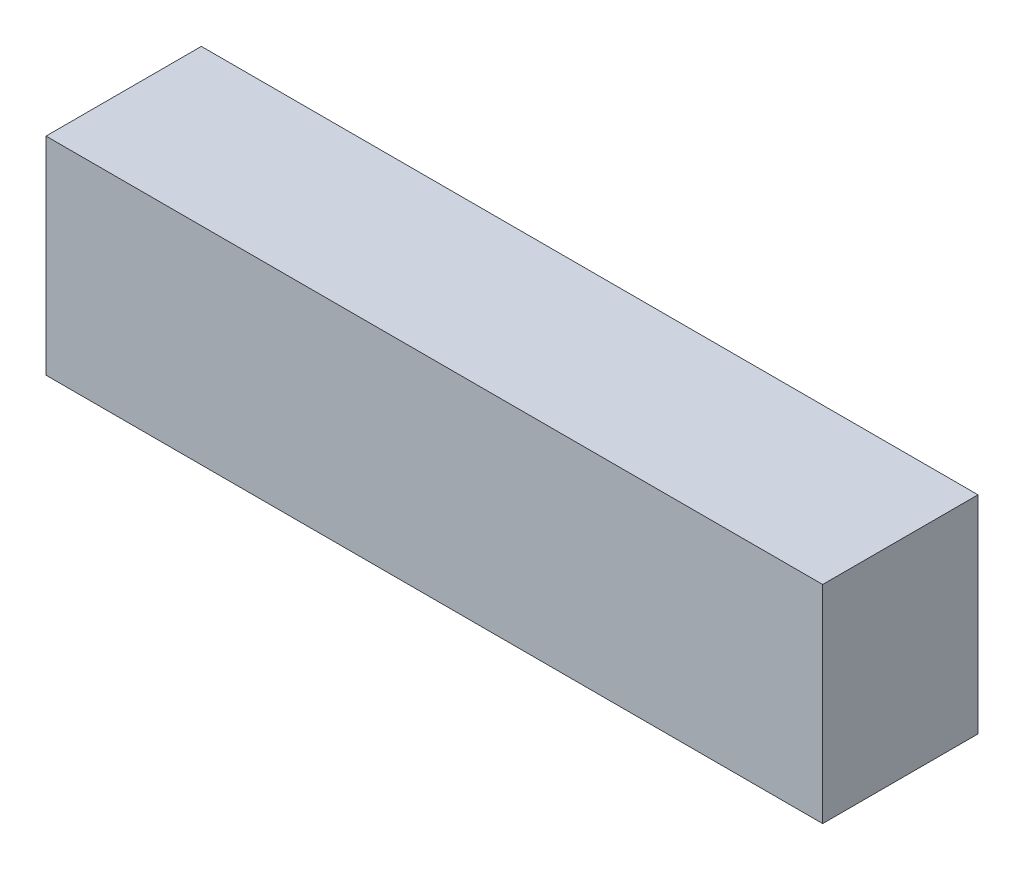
ISO-10303-21;
HEADER;
FILE_DESCRIPTION(('STEP AP214'),'2;1');
FILE_NAME('part.step','',(''),(''),'','','');
FILE_SCHEMA(('AUTOMOTIVE_DESIGN { 1 0 10303 214 1 1 1 1 }'));
ENDSEC;
DATA;
#1=APPLICATION_CONTEXT('core data for automotive mechanical design processes');
#2=APPLICATION_PROTOCOL_DEFINITION('international standard','automotive_design',2000,#1);
#3=PRODUCT_CONTEXT('',#1,'mechanical');
#4=PRODUCT('Part','Part','',(#3));
#5=PRODUCT_RELATED_PRODUCT_CATEGORY('part','',(#4));
#6=PRODUCT_DEFINITION_FORMATION('','',#4);
#7=PRODUCT_DEFINITION_CONTEXT('part definition',#1,'design');
#8=PRODUCT_DEFINITION('design','',#6,#7);
#9=PRODUCT_DEFINITION_SHAPE('','',#8);
#10=(LENGTH_UNIT() NAMED_UNIT(*) SI_UNIT(.MILLI.,.METRE.));
#11=(NAMED_UNIT(*) PLANE_ANGLE_UNIT() SI_UNIT($,.RADIAN.));
#12=(NAMED_UNIT(*) SI_UNIT($,.STERADIAN.) SOLID_ANGLE_UNIT());
#13=UNCERTAINTY_MEASURE_WITH_UNIT(LENGTH_MEASURE(1.E-05),#10,'distance_accuracy_value','');
#14=(GEOMETRIC_REPRESENTATION_CONTEXT(3) GLOBAL_UNCERTAINTY_ASSIGNED_CONTEXT((#13)) GLOBAL_UNIT_ASSIGNED_CONTEXT((#10,
#11,#12)) REPRESENTATION_CONTEXT('',''));
#15=CARTESIAN_POINT('',(0.,0.,0.));
#16=DIRECTION('',(0.,0.,1.));
#17=DIRECTION('',(1.,0.,0.));
#18=AXIS2_PLACEMENT_3D('',#15,#16,#17);
#19=CARTESIAN_POINT('',(95.25,25.4,38.1));
#20=DIRECTION('',(-1.,0.,0.));
#21=DIRECTION('',(0.,-1.,0.));
#22=AXIS2_PLACEMENT_3D('',#19,#20,#21);
#23=PLANE('',#22);
#24=DIRECTION('',(0.,1.,0.));
#25=VECTOR('',#24,1.);
#26=CARTESIAN_POINT('',(95.25,25.4,0.));
#27=LINE('',#26,#25);
#28=CARTESIAN_POINT('',(95.25,-25.4,0.));
#29=VERTEX_POINT('',#28);
#30=CARTESIAN_POINT('',(95.25,25.4,0.));
#31=VERTEX_POINT('',#30);
#32=EDGE_CURVE('E98',#29,#31,#27,.T.);
#33=ORIENTED_EDGE('',*,*,#32,.T.);
#34=DIRECTION('',(0.,0.,-1.));
#35=VECTOR('',#34,1.);
#36=CARTESIAN_POINT('',(95.25,25.4,38.1));
#37=LINE('',#36,#35);
#38=CARTESIAN_POINT('',(95.25,25.4,38.1));
#39=VERTEX_POINT('',#38);
#40=EDGE_CURVE('E11',#39,#31,#37,.T.);
#41=ORIENTED_EDGE('',*,*,#40,.F.);
#42=DIRECTION('',(0.,1.,0.));
#43=VECTOR('',#42,1.);
#44=CARTESIAN_POINT('',(95.25,25.4,38.1));
#45=LINE('',#44,#43);
#46=CARTESIAN_POINT('',(95.25,-25.4,38.1));
#47=VERTEX_POINT('',#46);
#48=EDGE_CURVE('E86',#47,#39,#45,.T.);
#49=ORIENTED_EDGE('',*,*,#48,.F.);
#50=DIRECTION('',(0.,0.,-1.));
#51=VECTOR('',#50,1.);
#52=CARTESIAN_POINT('',(95.25,-25.4,38.1));
#53=LINE('',#52,#51);
#54=EDGE_CURVE('E94',#47,#29,#53,.T.);
#55=ORIENTED_EDGE('',*,*,#54,.T.);
#56=EDGE_LOOP('',(#33,#41,#49,#55));
#57=FACE_BOUND('',#56,.T.);
#58=ADVANCED_FACE('F35',(#57),#23,.F.);
#59=CARTESIAN_POINT('',(-95.25,25.4,38.1));
#60=DIRECTION('',(0.,-1.,0.));
#61=DIRECTION('',(1.,0.,0.));
#62=AXIS2_PLACEMENT_3D('',#59,#60,#61);
#63=PLANE('',#62);
#64=DIRECTION('',(-1.,0.,0.));
#65=VECTOR('',#64,1.);
#66=CARTESIAN_POINT('',(-95.25,25.4,0.));
#67=LINE('',#66,#65);
#68=CARTESIAN_POINT('',(-95.25,25.4,0.));
#69=VERTEX_POINT('',#68);
#70=EDGE_CURVE('E90',#31,#69,#67,.T.);
#71=ORIENTED_EDGE('',*,*,#70,.T.);
#72=DIRECTION('',(0.,0.,-1.));
#73=VECTOR('',#72,1.);
#74=CARTESIAN_POINT('',(-95.25,25.4,38.1));
#75=LINE('',#74,#73);
#76=CARTESIAN_POINT('',(-95.25,25.4,38.1));
#77=VERTEX_POINT('',#76);
#78=EDGE_CURVE('E43',#77,#69,#75,.T.);
#79=ORIENTED_EDGE('',*,*,#78,.F.);
#80=DIRECTION('',(-1.,0.,0.));
#81=VECTOR('',#80,1.);
#82=CARTESIAN_POINT('',(-95.25,25.4,38.1));
#83=LINE('',#82,#81);
#84=EDGE_CURVE('E81',#39,#77,#83,.T.);
#85=ORIENTED_EDGE('',*,*,#84,.F.);
#86=ORIENTED_EDGE('',*,*,#40,.T.);
#87=EDGE_LOOP('',(#71,#79,#85,#86));
#88=FACE_BOUND('',#87,.T.);
#89=ADVANCED_FACE('F89',(#88),#63,.F.);
#90=CARTESIAN_POINT('',(-95.25,25.4,38.1));
#91=DIRECTION('',(1.,0.,0.));
#92=DIRECTION('',(0.,0.,-1.));
#93=AXIS2_PLACEMENT_3D('',#90,#91,#92);
#94=PLANE('',#93);
#95=DIRECTION('',(0.,-1.,0.));
#96=VECTOR('',#95,1.);
#97=CARTESIAN_POINT('',(-95.25,25.4,0.));
#98=LINE('',#97,#96);
#99=CARTESIAN_POINT('',(-95.25,-25.4,0.));
#100=VERTEX_POINT('',#99);
#101=EDGE_CURVE('E68',#69,#100,#98,.T.);
#102=ORIENTED_EDGE('',*,*,#101,.T.);
#103=DIRECTION('',(0.,0.,-1.));
#104=VECTOR('',#103,1.);
#105=CARTESIAN_POINT('',(-95.25,-25.4,38.1));
#106=LINE('',#105,#104);
#107=CARTESIAN_POINT('',(-95.25,-25.4,38.1));
#108=VERTEX_POINT('',#107);
#109=EDGE_CURVE('E91',#108,#100,#106,.T.);
#110=ORIENTED_EDGE('',*,*,#109,.F.);
#111=DIRECTION('',(0.,-1.,0.));
#112=VECTOR('',#111,1.);
#113=CARTESIAN_POINT('',(-95.25,25.4,38.1));
#114=LINE('',#113,#112);
#115=EDGE_CURVE('E84',#77,#108,#114,.T.);
#116=ORIENTED_EDGE('',*,*,#115,.F.);
#117=ORIENTED_EDGE('',*,*,#78,.T.);
#118=EDGE_LOOP('',(#102,#110,#116,#117));
#119=FACE_BOUND('',#118,.T.);
#120=ADVANCED_FACE('F92',(#119),#94,.F.);
#121=CARTESIAN_POINT('',(-95.25,-25.4,38.1));
#122=DIRECTION('',(0.,1.,0.));
#123=DIRECTION('',(0.,0.,1.));
#124=AXIS2_PLACEMENT_3D('',#121,#122,#123);
#125=PLANE('',#124);
#126=DIRECTION('',(1.,0.,0.));
#127=VECTOR('',#126,1.);
#128=CARTESIAN_POINT('',(-95.25,-25.4,0.));
#129=LINE('',#128,#127);
#130=EDGE_CURVE('E74',#100,#29,#129,.T.);
#131=ORIENTED_EDGE('',*,*,#130,.T.);
#132=ORIENTED_EDGE('',*,*,#54,.F.);
#133=DIRECTION('',(1.,0.,0.));
#134=VECTOR('',#133,1.);
#135=CARTESIAN_POINT('',(-95.25,-25.4,38.1));
#136=LINE('',#135,#134);
#137=EDGE_CURVE('E51',#108,#47,#136,.T.);
#138=ORIENTED_EDGE('',*,*,#137,.F.);
#139=ORIENTED_EDGE('',*,*,#109,.T.);
#140=EDGE_LOOP('',(#131,#132,#138,#139));
#141=FACE_BOUND('',#140,.T.);
#142=ADVANCED_FACE('F105',(#141),#125,.F.);
#143=CARTESIAN_POINT('',(0.,0.,38.1));
#144=DIRECTION('',(0.,0.,1.));
#145=DIRECTION('',(1.,0.,0.));
#146=AXIS2_PLACEMENT_3D('',#143,#144,#145);
#147=PLANE('',#146);
#148=ORIENTED_EDGE('',*,*,#48,.T.);
#149=ORIENTED_EDGE('',*,*,#84,.T.);
#150=ORIENTED_EDGE('',*,*,#115,.T.);
#151=ORIENTED_EDGE('',*,*,#137,.T.);
#152=EDGE_LOOP('',(#148,#149,#150,#151));
#153=FACE_BOUND('',#152,.T.);
#154=ADVANCED_FACE('F82',(#153),#147,.T.);
#155=CARTESIAN_POINT('',(0.,0.,0.));
#156=DIRECTION('',(0.,0.,1.));
#157=DIRECTION('',(1.,0.,0.));
#158=AXIS2_PLACEMENT_3D('',#155,#156,#157);
#159=PLANE('',#158);
#160=ORIENTED_EDGE('',*,*,#32,.F.);
#161=ORIENTED_EDGE('',*,*,#130,.F.);
#162=ORIENTED_EDGE('',*,*,#101,.F.);
#163=ORIENTED_EDGE('',*,*,#70,.F.);
#164=EDGE_LOOP('',(#160,#161,#162,#163));
#165=FACE_BOUND('',#164,.T.);
#166=ADVANCED_FACE('F108',(#165),#159,.F.);
#167=CLOSED_SHELL('',(#58,#89,#120,#142,#154,#166));
#168=MANIFOLD_SOLID_BREP('B2',#167);
#169=ADVANCED_BREP_SHAPE_REPRESENTATION('',(#18,#168),#14);
#170=SHAPE_DEFINITION_REPRESENTATION(#9,#169);
ENDSEC;
END-ISO-10303-21;
